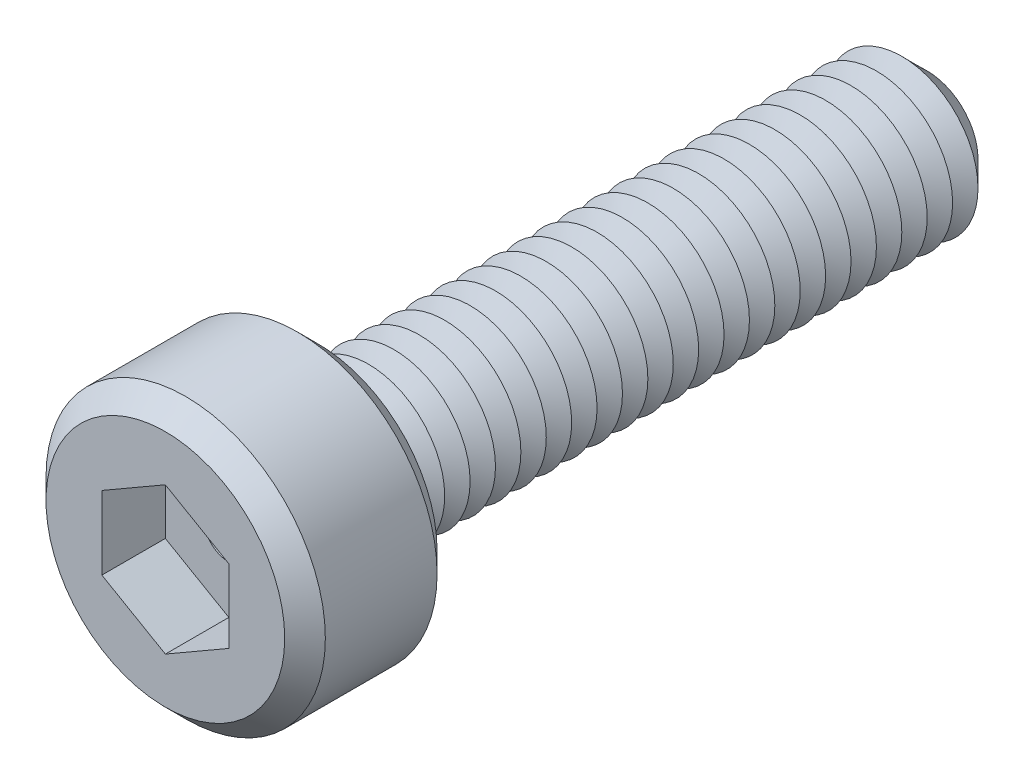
from build123d import *

# Parameters (mm, degrees)
SKETCH1_R           = 2.75
BOSS_EXTRUDE1_DEPTH = 3
SKETCH2_R           = 1.5
BOSS_EXTRUDE2_DEPTH = 12
CHAMFER1_SIZE       = 0.5
LPATTERN1_COUNT     = 23
LPATTERN1_PITCH     = 0.5
CUT_EXTRUDE1_DEPTH  = 1.25
SKETCH6_R           = 0.5
CUT_EXTRUDE2_DEPTH  = 13.75
CHAMFER2_SIZE       = 0.4


with BuildPart() as part:
    # Sketch1 → Boss-Extrude1 (new body)
    with BuildSketch(Plane.XY):
        Circle(SKETCH1_R)
    extrude(amount=BOSS_EXTRUDE1_DEPTH)

    # Sketch2 → Boss-Extrude2 (add)
    with BuildSketch(Plane(origin=(0, 0, 0), x_dir=(-1, 0, 0), z_dir=(0, 0, -1))):
        Circle(SKETCH2_R)
    extrude(amount=BOSS_EXTRUDE2_DEPTH)

    # Chamfer1
    chamfer1_edges = [part.edges().sort_by_distance(p)[0] for p in [
        (1.5, 0, -12),
    ]]
    chamfer(chamfer1_edges, length=CHAMFER1_SIZE)

    # Sketch4 → Cut-Revolve1 (revolve, cut)
    with BuildSketch(Plane(origin=(0, 0, 0), x_dir=(0, 0, -1), z_dir=(1, 0, 0)), mode=Mode.PRIVATE) as cut_revolve1_sk:
        Polygon((0, 1.5), (0.25, 1.066987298), (0.5, 1.5), align=None)
    cut_revolve1 = revolve(cut_revolve1_sk.sketch.rotate(Axis((0, 0, 2.512122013), (0, 0, -1)), 90), axis=Axis((0, 0, 2.512122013), (0, 0, -1)), mode=Mode.SUBTRACT)

    # LPattern1: Cut-Revolve1 ×23
    with Locations(*[(0, 0, -i * LPATTERN1_PITCH) for i in range(1, LPATTERN1_COUNT)]):
        add(cut_revolve1, mode=Mode.SUBTRACT)

    # Sketch5 → Cut-Extrude1 (cut)
    with BuildSketch(Plane.XY.offset(3)):
        Polygon((0, 1.443375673), (-1.25, 0.721687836), (-1.25, -0.721687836), (0, -1.443375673), (1.25, -0.721687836), (1.25, 0.721687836), align=None)
    extrude(amount=-CUT_EXTRUDE1_DEPTH, mode=Mode.SUBTRACT)

    # Sketch6 → Cut-Extrude2 (cut)
    with BuildSketch(Plane.XY.offset(1.75)):
        Circle(SKETCH6_R)
    extrude(amount=-CUT_EXTRUDE2_DEPTH, mode=Mode.SUBTRACT)

    # Chamfer2
    chamfer2_edges = [part.edges().sort_by_distance(p)[0] for p in [
        (-2.75, 0, 0),
        (-2.75, 0, 3),
    ]]
    chamfer(chamfer2_edges, length=CHAMFER2_SIZE)


solid = part.part
